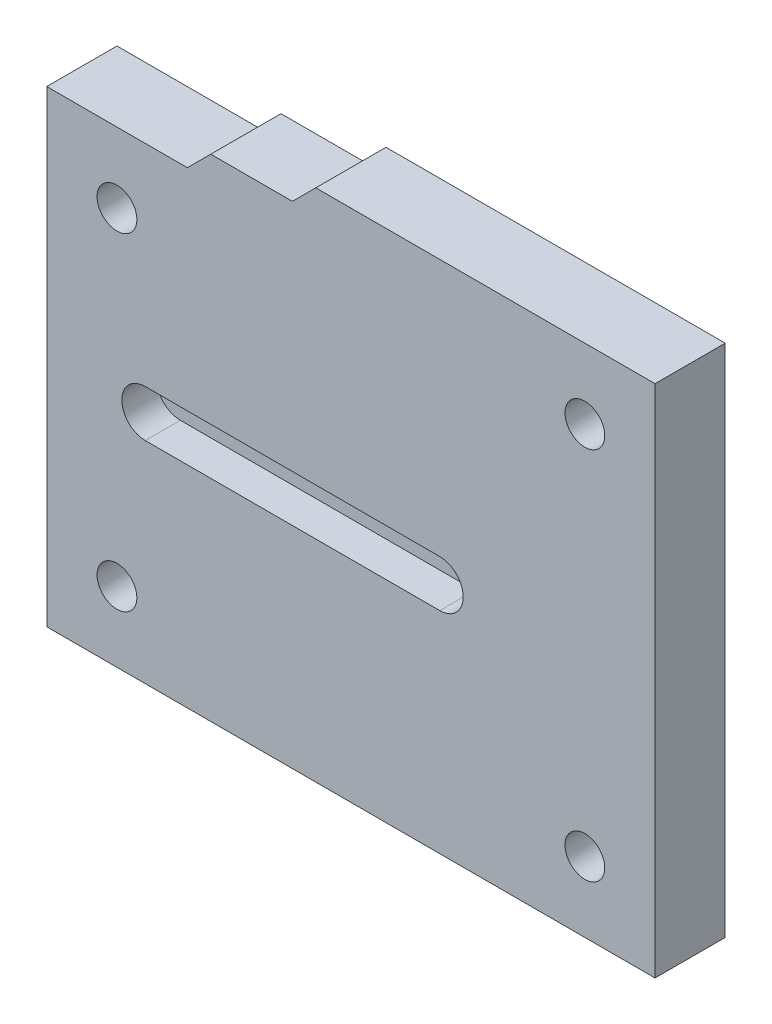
ISO-10303-21;
HEADER;
FILE_DESCRIPTION(('STEP AP214'),'2;1');
FILE_NAME('part.step','',(''),(''),'','','');
FILE_SCHEMA(('AUTOMOTIVE_DESIGN { 1 0 10303 214 1 1 1 1 }'));
ENDSEC;
DATA;
#1=APPLICATION_CONTEXT('core data for automotive mechanical design processes');
#2=APPLICATION_PROTOCOL_DEFINITION('international standard','automotive_design',2000,#1);
#3=PRODUCT_CONTEXT('',#1,'mechanical');
#4=PRODUCT('Part','Part','',(#3));
#5=PRODUCT_RELATED_PRODUCT_CATEGORY('part','',(#4));
#6=PRODUCT_DEFINITION_FORMATION('','',#4);
#7=PRODUCT_DEFINITION_CONTEXT('part definition',#1,'design');
#8=PRODUCT_DEFINITION('design','',#6,#7);
#9=PRODUCT_DEFINITION_SHAPE('','',#8);
#10=(LENGTH_UNIT() NAMED_UNIT(*) SI_UNIT(.MILLI.,.METRE.));
#11=(NAMED_UNIT(*) PLANE_ANGLE_UNIT() SI_UNIT($,.RADIAN.));
#12=(NAMED_UNIT(*) SI_UNIT($,.STERADIAN.) SOLID_ANGLE_UNIT());
#13=UNCERTAINTY_MEASURE_WITH_UNIT(LENGTH_MEASURE(1.E-05),#10,'distance_accuracy_value','');
#14=(GEOMETRIC_REPRESENTATION_CONTEXT(3) GLOBAL_UNCERTAINTY_ASSIGNED_CONTEXT((#13)) GLOBAL_UNIT_ASSIGNED_CONTEXT((#10,
#11,#12)) REPRESENTATION_CONTEXT('',''));
#15=CARTESIAN_POINT('',(0.,0.,0.));
#16=DIRECTION('',(0.,0.,1.));
#17=DIRECTION('',(1.,0.,0.));
#18=AXIS2_PLACEMENT_3D('',#15,#16,#17);
#19=CARTESIAN_POINT('',(-41.6094189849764,34.1564907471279,6.));
#20=DIRECTION('',(0.,0.,-1.));
#21=DIRECTION('',(-1.,0.,0.));
#22=AXIS2_PLACEMENT_3D('',#19,#20,#21);
#23=PLANE('',#22);
#24=CARTESIAN_POINT('',(-35.6094189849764,24.156490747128,6.));
#25=DIRECTION('',(0.,0.,-1.));
#26=DIRECTION('',(-1.,0.,0.));
#27=AXIS2_PLACEMENT_3D('',#24,#25,#26);
#28=CIRCLE('',#27,1.7);
#29=CARTESIAN_POINT('',(-37.3094189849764,24.156490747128,6.));
#30=VERTEX_POINT('',#29);
#31=EDGE_CURVE('E469',#30,#30,#28,.T.);
#32=ORIENTED_EDGE('',*,*,#31,.T.);
#33=EDGE_LOOP('',(#32));
#34=FACE_BOUND('',#33,.T.);
#35=CARTESIAN_POINT('',(-35.6094189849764,-3.84350925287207,6.));
#36=DIRECTION('',(0.,0.,-1.));
#37=DIRECTION('',(-1.,0.,0.));
#38=AXIS2_PLACEMENT_3D('',#35,#36,#37);
#39=CIRCLE('',#38,1.7);
#40=CARTESIAN_POINT('',(-37.3094189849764,-3.84350925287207,6.));
#41=VERTEX_POINT('',#40);
#42=EDGE_CURVE('E480',#41,#41,#39,.T.);
#43=ORIENTED_EDGE('',*,*,#42,.T.);
#44=EDGE_LOOP('',(#43));
#45=FACE_BOUND('',#44,.T.);
#46=CARTESIAN_POINT('',(4.3905810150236,28.156490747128,6.));
#47=DIRECTION('',(0.,0.,-1.));
#48=DIRECTION('',(-1.,0.,0.));
#49=AXIS2_PLACEMENT_3D('',#46,#47,#48);
#50=CIRCLE('',#49,1.7);
#51=CARTESIAN_POINT('',(2.6905810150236,28.156490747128,6.));
#52=VERTEX_POINT('',#51);
#53=EDGE_CURVE('E492',#52,#52,#50,.T.);
#54=ORIENTED_EDGE('',*,*,#53,.T.);
#55=EDGE_LOOP('',(#54));
#56=FACE_BOUND('',#55,.T.);
#57=CARTESIAN_POINT('',(4.3905810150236,-3.84350925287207,6.));
#58=DIRECTION('',(0.,0.,-1.));
#59=DIRECTION('',(-1.,0.,0.));
#60=AXIS2_PLACEMENT_3D('',#57,#58,#59);
#61=CIRCLE('',#60,1.7);
#62=CARTESIAN_POINT('',(2.6905810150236,-3.84350925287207,6.));
#63=VERTEX_POINT('',#62);
#64=EDGE_CURVE('E504',#63,#63,#61,.T.);
#65=ORIENTED_EDGE('',*,*,#64,.T.);
#66=EDGE_LOOP('',(#65));
#67=FACE_BOUND('',#66,.T.);
#68=DIRECTION('',(1.,0.,0.));
#69=VECTOR('',#68,1.);
#70=CARTESIAN_POINT('',(-20.6094189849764,32.1564907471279,6.));
#71=LINE('',#70,#69);
#72=CARTESIAN_POINT('',(-27.5894189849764,32.1564907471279,6.));
#73=VERTEX_POINT('',#72);
#74=CARTESIAN_POINT('',(-20.6094189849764,32.1564907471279,6.));
#75=VERTEX_POINT('',#74);
#76=EDGE_CURVE('E140',#73,#75,#71,.T.);
#77=ORIENTED_EDGE('',*,*,#76,.F.);
#78=DIRECTION('',(-0.707106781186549,-0.707106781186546,0.));
#79=VECTOR('',#78,1.);
#80=CARTESIAN_POINT('',(-29.5894189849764,30.156490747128,6.));
#81=LINE('',#80,#79);
#82=CARTESIAN_POINT('',(-29.5894189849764,30.156490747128,6.));
#83=VERTEX_POINT('',#82);
#84=EDGE_CURVE('E11',#73,#83,#81,.T.);
#85=ORIENTED_EDGE('',*,*,#84,.T.);
#86=DIRECTION('',(-1.,0.,0.));
#87=VECTOR('',#86,1.);
#88=CARTESIAN_POINT('',(-41.6094189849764,30.156490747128,6.));
#89=LINE('',#88,#87);
#90=CARTESIAN_POINT('',(-41.6094189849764,30.156490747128,6.));
#91=VERTEX_POINT('',#90);
#92=EDGE_CURVE('E147',#83,#91,#89,.T.);
#93=ORIENTED_EDGE('',*,*,#92,.T.);
#94=DIRECTION('',(0.,-1.,0.));
#95=VECTOR('',#94,1.);
#96=CARTESIAN_POINT('',(-41.6094189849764,-9.84350925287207,6.));
#97=LINE('',#96,#95);
#98=CARTESIAN_POINT('',(-41.6094189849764,-9.84350925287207,6.));
#99=VERTEX_POINT('',#98);
#100=EDGE_CURVE('E150',#91,#99,#97,.T.);
#101=ORIENTED_EDGE('',*,*,#100,.T.);
#102=DIRECTION('',(1.,0.,0.));
#103=VECTOR('',#102,1.);
#104=CARTESIAN_POINT('',(-41.6094189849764,-9.84350925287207,6.));
#105=LINE('',#104,#103);
#106=CARTESIAN_POINT('',(10.3905810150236,-9.84350925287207,6.));
#107=VERTEX_POINT('',#106);
#108=EDGE_CURVE('E152',#99,#107,#105,.T.);
#109=ORIENTED_EDGE('',*,*,#108,.T.);
#110=DIRECTION('',(0.,1.,0.));
#111=VECTOR('',#110,1.);
#112=CARTESIAN_POINT('',(10.3905810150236,-9.84350925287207,6.));
#113=LINE('',#112,#111);
#114=CARTESIAN_POINT('',(10.3905810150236,34.1564907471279,6.));
#115=VERTEX_POINT('',#114);
#116=EDGE_CURVE('E155',#107,#115,#113,.T.);
#117=ORIENTED_EDGE('',*,*,#116,.T.);
#118=DIRECTION('',(-1.,0.,0.));
#119=VECTOR('',#118,1.);
#120=CARTESIAN_POINT('',(-41.6094189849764,34.1564907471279,6.));
#121=LINE('',#120,#119);
#122=CARTESIAN_POINT('',(-18.6094189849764,34.1564907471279,6.));
#123=VERTEX_POINT('',#122);
#124=EDGE_CURVE('E157',#115,#123,#121,.T.);
#125=ORIENTED_EDGE('',*,*,#124,.T.);
#126=DIRECTION('',(0.707106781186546,0.707106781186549,0.));
#127=VECTOR('',#126,1.);
#128=CARTESIAN_POINT('',(-18.6094189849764,34.1564907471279,6.));
#129=LINE('',#128,#127);
#130=EDGE_CURVE('E179',#123,#75,#129,.F.);
#131=ORIENTED_EDGE('',*,*,#130,.T.);
#132=EDGE_LOOP('',(#77,#85,#93,#101,#109,#117,#125,#131));
#133=FACE_BOUND('',#132,.T.);
#134=CARTESIAN_POINT('',(-33.1894189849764,10.1564907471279,6.));
#135=DIRECTION('',(0.,0.,-1.));
#136=DIRECTION('',(-1.,0.,0.));
#137=AXIS2_PLACEMENT_3D('',#134,#135,#136);
#138=CIRCLE('',#137,2.);
#139=CARTESIAN_POINT('',(-33.1894189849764,8.15649074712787,6.));
#140=VERTEX_POINT('',#139);
#141=CARTESIAN_POINT('',(-33.1894189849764,12.1564907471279,6.));
#142=VERTEX_POINT('',#141);
#143=EDGE_CURVE('E506',#140,#142,#138,.T.);
#144=ORIENTED_EDGE('',*,*,#143,.T.);
#145=DIRECTION('',(1.,0.,0.));
#146=VECTOR('',#145,1.);
#147=CARTESIAN_POINT('',(-8.0094189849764,12.1564907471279,6.));
#148=LINE('',#147,#146);
#149=CARTESIAN_POINT('',(-8.0094189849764,12.1564907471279,6.));
#150=VERTEX_POINT('',#149);
#151=EDGE_CURVE('E125',#142,#150,#148,.T.);
#152=ORIENTED_EDGE('',*,*,#151,.T.);
#153=CARTESIAN_POINT('',(-8.0094189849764,10.1564907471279,6.));
#154=DIRECTION('',(0.,0.,-1.));
#155=DIRECTION('',(-1.,0.,0.));
#156=AXIS2_PLACEMENT_3D('',#153,#154,#155);
#157=CIRCLE('',#156,2.);
#158=CARTESIAN_POINT('',(-8.0094189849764,8.15649074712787,6.));
#159=VERTEX_POINT('',#158);
#160=EDGE_CURVE('E513',#150,#159,#157,.T.);
#161=ORIENTED_EDGE('',*,*,#160,.T.);
#162=DIRECTION('',(-1.,0.,0.));
#163=VECTOR('',#162,1.);
#164=CARTESIAN_POINT('',(-33.1894189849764,8.15649074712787,6.));
#165=LINE('',#164,#163);
#166=EDGE_CURVE('E121',#159,#140,#165,.T.);
#167=ORIENTED_EDGE('',*,*,#166,.T.);
#168=EDGE_LOOP('',(#144,#152,#161,#167));
#169=FACE_BOUND('',#168,.T.);
#170=ADVANCED_FACE('F16',(#34,#45,#56,#67,#133,#169),#23,.F.);
#171=CARTESIAN_POINT('',(-41.6094189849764,30.156490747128,8.));
#172=DIRECTION('',(0.,-1.,0.));
#173=DIRECTION('',(0.,0.,-1.));
#174=AXIS2_PLACEMENT_3D('',#171,#172,#173);
#175=PLANE('',#174);
#176=ORIENTED_EDGE('',*,*,#92,.F.);
#177=DIRECTION('',(0.,0.,-1.));
#178=VECTOR('',#177,1.);
#179=CARTESIAN_POINT('',(-29.5894189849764,30.156490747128,0.));
#180=LINE('',#179,#178);
#181=CARTESIAN_POINT('',(-29.5894189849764,30.156490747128,0.));
#182=VERTEX_POINT('',#181);
#183=EDGE_CURVE('E126',#83,#182,#180,.T.);
#184=ORIENTED_EDGE('',*,*,#183,.T.);
#185=DIRECTION('',(-1.,0.,0.));
#186=VECTOR('',#185,1.);
#187=CARTESIAN_POINT('',(-41.6094189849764,30.156490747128,0.));
#188=LINE('',#187,#186);
#189=CARTESIAN_POINT('',(-41.6094189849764,30.156490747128,0.));
#190=VERTEX_POINT('',#189);
#191=EDGE_CURVE('E142',#182,#190,#188,.T.);
#192=ORIENTED_EDGE('',*,*,#191,.T.);
#193=DIRECTION('',(0.,0.,-1.));
#194=VECTOR('',#193,1.);
#195=CARTESIAN_POINT('',(-41.6094189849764,30.156490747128,8.));
#196=LINE('',#195,#194);
#197=EDGE_CURVE('E144',#91,#190,#196,.T.);
#198=ORIENTED_EDGE('',*,*,#197,.F.);
#199=EDGE_LOOP('',(#176,#184,#192,#198));
#200=FACE_BOUND('',#199,.T.);
#201=ADVANCED_FACE('F215',(#200),#175,.F.);
#202=CARTESIAN_POINT('',(-41.6094189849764,-9.84350925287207,6.));
#203=DIRECTION('',(1.,0.,0.));
#204=DIRECTION('',(0.,0.,-1.));
#205=AXIS2_PLACEMENT_3D('',#202,#203,#204);
#206=PLANE('',#205);
#207=ORIENTED_EDGE('',*,*,#100,.F.);
#208=ORIENTED_EDGE('',*,*,#197,.T.);
#209=DIRECTION('',(0.,-1.,0.));
#210=VECTOR('',#209,1.);
#211=CARTESIAN_POINT('',(-41.6094189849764,-9.84350925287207,0.));
#212=LINE('',#211,#210);
#213=CARTESIAN_POINT('',(-41.6094189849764,-9.84350925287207,0.));
#214=VERTEX_POINT('',#213);
#215=EDGE_CURVE('E149',#190,#214,#212,.T.);
#216=ORIENTED_EDGE('',*,*,#215,.T.);
#217=DIRECTION('',(0.,0.,-1.));
#218=VECTOR('',#217,1.);
#219=CARTESIAN_POINT('',(-41.6094189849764,-9.84350925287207,6.));
#220=LINE('',#219,#218);
#221=EDGE_CURVE('E173',#99,#214,#220,.T.);
#222=ORIENTED_EDGE('',*,*,#221,.F.);
#223=EDGE_LOOP('',(#207,#208,#216,#222));
#224=FACE_BOUND('',#223,.T.);
#225=ADVANCED_FACE('F211',(#224),#206,.F.);
#226=CARTESIAN_POINT('',(-41.6094189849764,-9.84350925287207,6.));
#227=DIRECTION('',(0.,1.,0.));
#228=DIRECTION('',(0.,0.,1.));
#229=AXIS2_PLACEMENT_3D('',#226,#227,#228);
#230=PLANE('',#229);
#231=DIRECTION('',(1.,0.,0.));
#232=VECTOR('',#231,1.);
#233=CARTESIAN_POINT('',(-41.6094189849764,-9.84350925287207,0.));
#234=LINE('',#233,#232);
#235=CARTESIAN_POINT('',(10.3905810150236,-9.84350925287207,0.));
#236=VERTEX_POINT('',#235);
#237=EDGE_CURVE('E162',#214,#236,#234,.T.);
#238=ORIENTED_EDGE('',*,*,#237,.T.);
#239=DIRECTION('',(0.,0.,-1.));
#240=VECTOR('',#239,1.);
#241=CARTESIAN_POINT('',(10.3905810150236,-9.84350925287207,6.));
#242=LINE('',#241,#240);
#243=EDGE_CURVE('E170',#107,#236,#242,.T.);
#244=ORIENTED_EDGE('',*,*,#243,.F.);
#245=ORIENTED_EDGE('',*,*,#108,.F.);
#246=ORIENTED_EDGE('',*,*,#221,.T.);
#247=EDGE_LOOP('',(#238,#244,#245,#246));
#248=FACE_BOUND('',#247,.T.);
#249=ADVANCED_FACE('F208',(#248),#230,.F.);
#250=CARTESIAN_POINT('',(10.3905810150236,-9.84350925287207,6.));
#251=DIRECTION('',(-1.,0.,0.));
#252=DIRECTION('',(0.,0.,1.));
#253=AXIS2_PLACEMENT_3D('',#250,#251,#252);
#254=PLANE('',#253);
#255=DIRECTION('',(0.,1.,0.));
#256=VECTOR('',#255,1.);
#257=CARTESIAN_POINT('',(10.3905810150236,-9.84350925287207,0.));
#258=LINE('',#257,#256);
#259=CARTESIAN_POINT('',(10.3905810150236,34.1564907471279,0.));
#260=VERTEX_POINT('',#259);
#261=EDGE_CURVE('E164',#236,#260,#258,.T.);
#262=ORIENTED_EDGE('',*,*,#261,.T.);
#263=DIRECTION('',(0.,0.,-1.));
#264=VECTOR('',#263,1.);
#265=CARTESIAN_POINT('',(10.3905810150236,34.1564907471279,6.));
#266=LINE('',#265,#264);
#267=EDGE_CURVE('E160',#115,#260,#266,.T.);
#268=ORIENTED_EDGE('',*,*,#267,.F.);
#269=ORIENTED_EDGE('',*,*,#116,.F.);
#270=ORIENTED_EDGE('',*,*,#243,.T.);
#271=EDGE_LOOP('',(#262,#268,#269,#270));
#272=FACE_BOUND('',#271,.T.);
#273=ADVANCED_FACE('F203',(#272),#254,.F.);
#274=CARTESIAN_POINT('',(-41.6094189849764,34.1564907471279,6.));
#275=DIRECTION('',(0.,-1.,0.));
#276=DIRECTION('',(0.,0.,-1.));
#277=AXIS2_PLACEMENT_3D('',#274,#275,#276);
#278=PLANE('',#277);
#279=DIRECTION('',(-1.,0.,0.));
#280=VECTOR('',#279,1.);
#281=CARTESIAN_POINT('',(-41.6094189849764,34.1564907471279,0.));
#282=LINE('',#281,#280);
#283=CARTESIAN_POINT('',(-18.6094189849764,34.1564907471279,0.));
#284=VERTEX_POINT('',#283);
#285=EDGE_CURVE('E153',#260,#284,#282,.T.);
#286=ORIENTED_EDGE('',*,*,#285,.T.);
#287=DIRECTION('',(0.,0.,1.));
#288=VECTOR('',#287,1.);
#289=CARTESIAN_POINT('',(-18.6094189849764,34.1564907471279,6.));
#290=LINE('',#289,#288);
#291=EDGE_CURVE('E176',#284,#123,#290,.T.);
#292=ORIENTED_EDGE('',*,*,#291,.T.);
#293=ORIENTED_EDGE('',*,*,#124,.F.);
#294=ORIENTED_EDGE('',*,*,#267,.T.);
#295=EDGE_LOOP('',(#286,#292,#293,#294));
#296=FACE_BOUND('',#295,.T.);
#297=ADVANCED_FACE('F192',(#296),#278,.F.);
#298=CARTESIAN_POINT('',(-41.6094189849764,34.1564907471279,0.));
#299=DIRECTION('',(0.,0.,-1.));
#300=DIRECTION('',(-1.,0.,0.));
#301=AXIS2_PLACEMENT_3D('',#298,#299,#300);
#302=PLANE('',#301);
#303=CARTESIAN_POINT('',(-35.6094189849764,24.156490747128,0.));
#304=DIRECTION('',(0.,0.,-1.));
#305=DIRECTION('',(-1.,0.,0.));
#306=AXIS2_PLACEMENT_3D('',#303,#304,#305);
#307=CIRCLE('',#306,3.1);
#308=CARTESIAN_POINT('',(-38.7094189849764,24.156490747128,0.));
#309=VERTEX_POINT('',#308);
#310=EDGE_CURVE('E462',#309,#309,#307,.T.);
#311=ORIENTED_EDGE('',*,*,#310,.F.);
#312=EDGE_LOOP('',(#311));
#313=FACE_BOUND('',#312,.T.);
#314=CARTESIAN_POINT('',(-35.6094189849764,-3.84350925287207,0.));
#315=DIRECTION('',(0.,0.,-1.));
#316=DIRECTION('',(-1.,0.,0.));
#317=AXIS2_PLACEMENT_3D('',#314,#315,#316);
#318=CIRCLE('',#317,3.1);
#319=CARTESIAN_POINT('',(-38.7094189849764,-3.84350925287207,0.));
#320=VERTEX_POINT('',#319);
#321=EDGE_CURVE('E471',#320,#320,#318,.T.);
#322=ORIENTED_EDGE('',*,*,#321,.F.);
#323=EDGE_LOOP('',(#322));
#324=FACE_BOUND('',#323,.T.);
#325=CARTESIAN_POINT('',(4.3905810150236,28.156490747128,0.));
#326=DIRECTION('',(0.,0.,-1.));
#327=DIRECTION('',(-1.,0.,0.));
#328=AXIS2_PLACEMENT_3D('',#325,#326,#327);
#329=CIRCLE('',#328,3.1);
#330=CARTESIAN_POINT('',(1.2905810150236,28.156490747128,0.));
#331=VERTEX_POINT('',#330);
#332=EDGE_CURVE('E483',#331,#331,#329,.T.);
#333=ORIENTED_EDGE('',*,*,#332,.F.);
#334=EDGE_LOOP('',(#333));
#335=FACE_BOUND('',#334,.T.);
#336=CARTESIAN_POINT('',(4.3905810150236,-3.84350925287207,0.));
#337=DIRECTION('',(0.,0.,-1.));
#338=DIRECTION('',(-1.,0.,0.));
#339=AXIS2_PLACEMENT_3D('',#336,#337,#338);
#340=CIRCLE('',#339,3.1);
#341=CARTESIAN_POINT('',(1.2905810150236,-3.84350925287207,0.));
#342=VERTEX_POINT('',#341);
#343=EDGE_CURVE('E495',#342,#342,#340,.T.);
#344=ORIENTED_EDGE('',*,*,#343,.F.);
#345=EDGE_LOOP('',(#344));
#346=FACE_BOUND('',#345,.T.);
#347=ORIENTED_EDGE('',*,*,#191,.F.);
#348=DIRECTION('',(0.707106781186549,0.707106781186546,0.));
#349=VECTOR('',#348,1.);
#350=CARTESIAN_POINT('',(-33.5994189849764,26.146490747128,0.));
#351=LINE('',#350,#349);
#352=CARTESIAN_POINT('',(-27.5894189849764,32.1564907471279,0.));
#353=VERTEX_POINT('',#352);
#354=EDGE_CURVE('E38',#182,#353,#351,.T.);
#355=ORIENTED_EDGE('',*,*,#354,.T.);
#356=DIRECTION('',(-1.,0.,0.));
#357=VECTOR('',#356,1.);
#358=CARTESIAN_POINT('',(-20.6094189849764,32.1564907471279,0.));
#359=LINE('',#358,#357);
#360=CARTESIAN_POINT('',(-20.6094189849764,32.1564907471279,0.));
#361=VERTEX_POINT('',#360);
#362=EDGE_CURVE('E138',#361,#353,#359,.T.);
#363=ORIENTED_EDGE('',*,*,#362,.F.);
#364=DIRECTION('',(-0.707106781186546,-0.707106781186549,0.));
#365=VECTOR('',#364,1.);
#366=CARTESIAN_POINT('',(-30.1094189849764,22.656490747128,0.));
#367=LINE('',#366,#365);
#368=EDGE_CURVE('E182',#361,#284,#367,.F.);
#369=ORIENTED_EDGE('',*,*,#368,.T.);
#370=ORIENTED_EDGE('',*,*,#285,.F.);
#371=ORIENTED_EDGE('',*,*,#261,.F.);
#372=ORIENTED_EDGE('',*,*,#237,.F.);
#373=ORIENTED_EDGE('',*,*,#215,.F.);
#374=EDGE_LOOP('',(#347,#355,#363,#369,#370,#371,#372,#373));
#375=FACE_BOUND('',#374,.T.);
#376=ADVANCED_FACE('F186',(#313,#324,#335,#346,#375),#302,.T.);
#377=CARTESIAN_POINT('',(-20.6094189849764,32.1564907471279,0.));
#378=DIRECTION('',(0.,1.,0.));
#379=DIRECTION('',(0.,0.,1.));
#380=AXIS2_PLACEMENT_3D('',#377,#378,#379);
#381=PLANE('',#380);
#382=ORIENTED_EDGE('',*,*,#362,.T.);
#383=DIRECTION('',(0.,0.,1.));
#384=VECTOR('',#383,1.);
#385=CARTESIAN_POINT('',(-27.5894189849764,32.1564907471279,6.));
#386=LINE('',#385,#384);
#387=EDGE_CURVE('E24',#353,#73,#386,.T.);
#388=ORIENTED_EDGE('',*,*,#387,.T.);
#389=ORIENTED_EDGE('',*,*,#76,.T.);
#390=DIRECTION('',(0.,0.,-1.));
#391=VECTOR('',#390,1.);
#392=CARTESIAN_POINT('',(-20.6094189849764,32.1564907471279,6.));
#393=LINE('',#392,#391);
#394=EDGE_CURVE('E130',#75,#361,#393,.T.);
#395=ORIENTED_EDGE('',*,*,#394,.T.);
#396=EDGE_LOOP('',(#382,#388,#389,#395));
#397=FACE_BOUND('',#396,.T.);
#398=ADVANCED_FACE('F243',(#397),#381,.T.);
#399=CARTESIAN_POINT('',(-33.1894189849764,10.1564907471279,3.));
#400=DIRECTION('',(0.,0.,1.));
#401=DIRECTION('',(1.,0.,0.));
#402=AXIS2_PLACEMENT_3D('',#399,#400,#401);
#403=CYLINDRICAL_SURFACE('',#402,2.);
#404=ORIENTED_EDGE('',*,*,#143,.F.);
#405=DIRECTION('',(0.,0.,1.));
#406=VECTOR('',#405,1.);
#407=CARTESIAN_POINT('',(-33.1894189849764,8.15649074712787,3.));
#408=LINE('',#407,#406);
#409=CARTESIAN_POINT('',(-33.1894189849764,8.15649074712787,3.));
#410=VERTEX_POINT('',#409);
#411=EDGE_CURVE('E120',#410,#140,#408,.T.);
#412=ORIENTED_EDGE('',*,*,#411,.F.);
#413=CARTESIAN_POINT('',(-33.1894189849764,10.1564907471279,3.));
#414=DIRECTION('',(0.,0.,-1.));
#415=DIRECTION('',(-1.,0.,0.));
#416=AXIS2_PLACEMENT_3D('',#413,#414,#415);
#417=CIRCLE('',#416,2.);
#418=CARTESIAN_POINT('',(-33.1894189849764,12.1564907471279,3.));
#419=VERTEX_POINT('',#418);
#420=EDGE_CURVE('E107',#410,#419,#417,.T.);
#421=ORIENTED_EDGE('',*,*,#420,.T.);
#422=DIRECTION('',(0.,0.,1.));
#423=VECTOR('',#422,1.);
#424=CARTESIAN_POINT('',(-33.1894189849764,12.1564907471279,3.));
#425=LINE('',#424,#423);
#426=EDGE_CURVE('E117',#419,#142,#425,.T.);
#427=ORIENTED_EDGE('',*,*,#426,.T.);
#428=EDGE_LOOP('',(#404,#412,#421,#427));
#429=FACE_BOUND('',#428,.T.);
#430=ADVANCED_FACE('F116',(#429),#403,.F.);
#431=CARTESIAN_POINT('',(-8.0094189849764,12.1564907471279,3.));
#432=DIRECTION('',(0.,-1.,0.));
#433=DIRECTION('',(0.,0.,-1.));
#434=AXIS2_PLACEMENT_3D('',#431,#432,#433);
#435=PLANE('',#434);
#436=ORIENTED_EDGE('',*,*,#151,.F.);
#437=ORIENTED_EDGE('',*,*,#426,.F.);
#438=DIRECTION('',(1.,0.,0.));
#439=VECTOR('',#438,1.);
#440=CARTESIAN_POINT('',(-8.0094189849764,12.1564907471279,3.));
#441=LINE('',#440,#439);
#442=CARTESIAN_POINT('',(-8.0094189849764,12.1564907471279,3.));
#443=VERTEX_POINT('',#442);
#444=EDGE_CURVE('E103',#419,#443,#441,.T.);
#445=ORIENTED_EDGE('',*,*,#444,.T.);
#446=DIRECTION('',(0.,0.,1.));
#447=VECTOR('',#446,1.);
#448=CARTESIAN_POINT('',(-8.0094189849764,12.1564907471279,3.));
#449=LINE('',#448,#447);
#450=EDGE_CURVE('E127',#443,#150,#449,.T.);
#451=ORIENTED_EDGE('',*,*,#450,.T.);
#452=EDGE_LOOP('',(#436,#437,#445,#451));
#453=FACE_BOUND('',#452,.T.);
#454=ADVANCED_FACE('F123',(#453),#435,.T.);
#455=CARTESIAN_POINT('',(-8.0094189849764,10.1564907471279,3.));
#456=DIRECTION('',(0.,0.,1.));
#457=DIRECTION('',(1.,0.,0.));
#458=AXIS2_PLACEMENT_3D('',#455,#456,#457);
#459=CYLINDRICAL_SURFACE('',#458,2.);
#460=ORIENTED_EDGE('',*,*,#160,.F.);
#461=ORIENTED_EDGE('',*,*,#450,.F.);
#462=CARTESIAN_POINT('',(-8.0094189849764,10.1564907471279,3.));
#463=DIRECTION('',(0.,0.,-1.));
#464=DIRECTION('',(-1.,0.,0.));
#465=AXIS2_PLACEMENT_3D('',#462,#463,#464);
#466=CIRCLE('',#465,2.);
#467=CARTESIAN_POINT('',(-8.0094189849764,8.15649074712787,3.));
#468=VERTEX_POINT('',#467);
#469=EDGE_CURVE('E108',#443,#468,#466,.T.);
#470=ORIENTED_EDGE('',*,*,#469,.T.);
#471=DIRECTION('',(0.,0.,1.));
#472=VECTOR('',#471,1.);
#473=CARTESIAN_POINT('',(-8.0094189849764,8.15649074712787,3.));
#474=LINE('',#473,#472);
#475=EDGE_CURVE('E132',#468,#159,#474,.T.);
#476=ORIENTED_EDGE('',*,*,#475,.T.);
#477=EDGE_LOOP('',(#460,#461,#470,#476));
#478=FACE_BOUND('',#477,.T.);
#479=ADVANCED_FACE('F301',(#478),#459,.F.);
#480=CARTESIAN_POINT('',(-33.1894189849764,8.15649074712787,3.));
#481=DIRECTION('',(0.,1.,0.));
#482=DIRECTION('',(0.,0.,1.));
#483=AXIS2_PLACEMENT_3D('',#480,#481,#482);
#484=PLANE('',#483);
#485=ORIENTED_EDGE('',*,*,#166,.F.);
#486=ORIENTED_EDGE('',*,*,#475,.F.);
#487=DIRECTION('',(-1.,0.,0.));
#488=VECTOR('',#487,1.);
#489=CARTESIAN_POINT('',(-33.1894189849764,8.15649074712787,3.));
#490=LINE('',#489,#488);
#491=EDGE_CURVE('E509',#468,#410,#490,.T.);
#492=ORIENTED_EDGE('',*,*,#491,.T.);
#493=ORIENTED_EDGE('',*,*,#411,.T.);
#494=EDGE_LOOP('',(#485,#486,#492,#493));
#495=FACE_BOUND('',#494,.T.);
#496=ADVANCED_FACE('F309',(#495),#484,.T.);
#497=CARTESIAN_POINT('',(-33.1894189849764,10.1564907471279,3.));
#498=DIRECTION('',(0.,0.,-1.));
#499=DIRECTION('',(-1.,0.,0.));
#500=AXIS2_PLACEMENT_3D('',#497,#498,#499);
#501=PLANE('',#500);
#502=ORIENTED_EDGE('',*,*,#420,.F.);
#503=ORIENTED_EDGE('',*,*,#491,.F.);
#504=ORIENTED_EDGE('',*,*,#469,.F.);
#505=ORIENTED_EDGE('',*,*,#444,.F.);
#506=EDGE_LOOP('',(#502,#503,#504,#505));
#507=FACE_BOUND('',#506,.T.);
#508=ADVANCED_FACE('F105',(#507),#501,.F.);
#509=CARTESIAN_POINT('',(-18.6094189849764,34.1564907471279,6.));
#510=DIRECTION('',(0.707106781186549,-0.707106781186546,0.));
#511=DIRECTION('',(0.707106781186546,0.707106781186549,0.));
#512=AXIS2_PLACEMENT_3D('',#509,#510,#511);
#513=PLANE('',#512);
#514=ORIENTED_EDGE('',*,*,#368,.F.);
#515=ORIENTED_EDGE('',*,*,#394,.F.);
#516=ORIENTED_EDGE('',*,*,#130,.F.);
#517=ORIENTED_EDGE('',*,*,#291,.F.);
#518=EDGE_LOOP('',(#514,#515,#516,#517));
#519=FACE_BOUND('',#518,.T.);
#520=ADVANCED_FACE('F195',(#519),#513,.F.);
#521=CARTESIAN_POINT('',(-29.5894189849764,30.156490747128,0.));
#522=DIRECTION('',(-0.707106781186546,0.707106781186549,0.));
#523=DIRECTION('',(-0.707106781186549,-0.707106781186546,0.));
#524=AXIS2_PLACEMENT_3D('',#521,#522,#523);
#525=PLANE('',#524);
#526=ORIENTED_EDGE('',*,*,#84,.F.);
#527=ORIENTED_EDGE('',*,*,#387,.F.);
#528=ORIENTED_EDGE('',*,*,#354,.F.);
#529=ORIENTED_EDGE('',*,*,#183,.F.);
#530=EDGE_LOOP('',(#526,#527,#528,#529));
#531=FACE_BOUND('',#530,.T.);
#532=ADVANCED_FACE('F18',(#531),#525,.T.);
#533=CARTESIAN_POINT('',(4.3905810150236,-3.84350925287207,0.));
#534=DIRECTION('',(0.,0.,-1.));
#535=DIRECTION('',(-1.,0.,0.));
#536=AXIS2_PLACEMENT_3D('',#533,#534,#535);
#537=CYLINDRICAL_SURFACE('',#536,1.7);
#538=ORIENTED_EDGE('',*,*,#64,.F.);
#539=EDGE_LOOP('',(#538));
#540=FACE_BOUND('',#539,.T.);
#541=CARTESIAN_POINT('',(4.3905810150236,-3.84350925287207,3.));
#542=DIRECTION('',(0.,0.,-1.));
#543=DIRECTION('',(-1.,0.,0.));
#544=AXIS2_PLACEMENT_3D('',#541,#542,#543);
#545=CIRCLE('',#544,1.7);
#546=CARTESIAN_POINT('',(2.6905810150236,-3.84350925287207,3.));
#547=VERTEX_POINT('',#546);
#548=EDGE_CURVE('E501',#547,#547,#545,.T.);
#549=ORIENTED_EDGE('',*,*,#548,.T.);
#550=EDGE_LOOP('',(#549));
#551=FACE_BOUND('',#550,.T.);
#552=ADVANCED_FACE('F219',(#540,#551),#537,.F.);
#553=CARTESIAN_POINT('',(6.09058101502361,-3.84350925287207,3.));
#554=DIRECTION('',(0.,0.,1.));
#555=DIRECTION('',(1.,0.,0.));
#556=AXIS2_PLACEMENT_3D('',#553,#554,#555);
#557=PLANE('',#556);
#558=ORIENTED_EDGE('',*,*,#548,.F.);
#559=EDGE_LOOP('',(#558));
#560=FACE_BOUND('',#559,.T.);
#561=CARTESIAN_POINT('',(4.3905810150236,-3.84350925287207,3.));
#562=DIRECTION('',(0.,0.,-1.));
#563=DIRECTION('',(-1.,0.,0.));
#564=AXIS2_PLACEMENT_3D('',#561,#562,#563);
#565=CIRCLE('',#564,3.1);
#566=CARTESIAN_POINT('',(1.2905810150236,-3.84350925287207,3.));
#567=VERTEX_POINT('',#566);
#568=EDGE_CURVE('E498',#567,#567,#565,.T.);
#569=ORIENTED_EDGE('',*,*,#568,.T.);
#570=EDGE_LOOP('',(#569));
#571=FACE_BOUND('',#570,.T.);
#572=ADVANCED_FACE('F226',(#560,#571),#557,.F.);
#573=CARTESIAN_POINT('',(4.3905810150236,-3.84350925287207,0.));
#574=DIRECTION('',(0.,0.,-1.));
#575=DIRECTION('',(-1.,0.,0.));
#576=AXIS2_PLACEMENT_3D('',#573,#574,#575);
#577=CYLINDRICAL_SURFACE('',#576,3.1);
#578=ORIENTED_EDGE('',*,*,#568,.F.);
#579=EDGE_LOOP('',(#578));
#580=FACE_BOUND('',#579,.T.);
#581=ORIENTED_EDGE('',*,*,#343,.T.);
#582=EDGE_LOOP('',(#581));
#583=FACE_BOUND('',#582,.T.);
#584=ADVANCED_FACE('F350',(#580,#583),#577,.F.);
#585=CARTESIAN_POINT('',(4.3905810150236,28.156490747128,0.));
#586=DIRECTION('',(0.,0.,-1.));
#587=DIRECTION('',(-1.,0.,0.));
#588=AXIS2_PLACEMENT_3D('',#585,#586,#587);
#589=CYLINDRICAL_SURFACE('',#588,1.7);
#590=ORIENTED_EDGE('',*,*,#53,.F.);
#591=EDGE_LOOP('',(#590));
#592=FACE_BOUND('',#591,.T.);
#593=CARTESIAN_POINT('',(4.3905810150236,28.156490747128,3.));
#594=DIRECTION('',(0.,0.,-1.));
#595=DIRECTION('',(-1.,0.,0.));
#596=AXIS2_PLACEMENT_3D('',#593,#594,#595);
#597=CIRCLE('',#596,1.7);
#598=CARTESIAN_POINT('',(2.6905810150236,28.156490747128,3.));
#599=VERTEX_POINT('',#598);
#600=EDGE_CURVE('E489',#599,#599,#597,.T.);
#601=ORIENTED_EDGE('',*,*,#600,.T.);
#602=EDGE_LOOP('',(#601));
#603=FACE_BOUND('',#602,.T.);
#604=ADVANCED_FACE('F360',(#592,#603),#589,.F.);
#605=CARTESIAN_POINT('',(6.09058101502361,28.156490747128,3.));
#606=DIRECTION('',(0.,0.,1.));
#607=DIRECTION('',(1.,0.,0.));
#608=AXIS2_PLACEMENT_3D('',#605,#606,#607);
#609=PLANE('',#608);
#610=ORIENTED_EDGE('',*,*,#600,.F.);
#611=EDGE_LOOP('',(#610));
#612=FACE_BOUND('',#611,.T.);
#613=CARTESIAN_POINT('',(4.3905810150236,28.156490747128,3.));
#614=DIRECTION('',(0.,0.,-1.));
#615=DIRECTION('',(-1.,0.,0.));
#616=AXIS2_PLACEMENT_3D('',#613,#614,#615);
#617=CIRCLE('',#616,3.1);
#618=CARTESIAN_POINT('',(1.2905810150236,28.156490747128,3.));
#619=VERTEX_POINT('',#618);
#620=EDGE_CURVE('E486',#619,#619,#617,.T.);
#621=ORIENTED_EDGE('',*,*,#620,.T.);
#622=EDGE_LOOP('',(#621));
#623=FACE_BOUND('',#622,.T.);
#624=ADVANCED_FACE('F370',(#612,#623),#609,.F.);
#625=CARTESIAN_POINT('',(4.3905810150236,28.156490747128,0.));
#626=DIRECTION('',(0.,0.,-1.));
#627=DIRECTION('',(-1.,0.,0.));
#628=AXIS2_PLACEMENT_3D('',#625,#626,#627);
#629=CYLINDRICAL_SURFACE('',#628,3.1);
#630=ORIENTED_EDGE('',*,*,#620,.F.);
#631=EDGE_LOOP('',(#630));
#632=FACE_BOUND('',#631,.T.);
#633=ORIENTED_EDGE('',*,*,#332,.T.);
#634=EDGE_LOOP('',(#633));
#635=FACE_BOUND('',#634,.T.);
#636=ADVANCED_FACE('F380',(#632,#635),#629,.F.);
#637=CARTESIAN_POINT('',(-35.6094189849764,-3.84350925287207,0.));
#638=DIRECTION('',(0.,0.,-1.));
#639=DIRECTION('',(-1.,0.,0.));
#640=AXIS2_PLACEMENT_3D('',#637,#638,#639);
#641=CYLINDRICAL_SURFACE('',#640,1.7);
#642=ORIENTED_EDGE('',*,*,#42,.F.);
#643=EDGE_LOOP('',(#642));
#644=FACE_BOUND('',#643,.T.);
#645=CARTESIAN_POINT('',(-35.6094189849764,-3.84350925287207,3.));
#646=DIRECTION('',(0.,0.,-1.));
#647=DIRECTION('',(-1.,0.,0.));
#648=AXIS2_PLACEMENT_3D('',#645,#646,#647);
#649=CIRCLE('',#648,1.7);
#650=CARTESIAN_POINT('',(-37.3094189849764,-3.84350925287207,3.));
#651=VERTEX_POINT('',#650);
#652=EDGE_CURVE('E477',#651,#651,#649,.T.);
#653=ORIENTED_EDGE('',*,*,#652,.T.);
#654=EDGE_LOOP('',(#653));
#655=FACE_BOUND('',#654,.T.);
#656=ADVANCED_FACE('F390',(#644,#655),#641,.F.);
#657=CARTESIAN_POINT('',(-33.9094189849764,-3.84350925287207,3.));
#658=DIRECTION('',(0.,0.,1.));
#659=DIRECTION('',(1.,0.,0.));
#660=AXIS2_PLACEMENT_3D('',#657,#658,#659);
#661=PLANE('',#660);
#662=ORIENTED_EDGE('',*,*,#652,.F.);
#663=EDGE_LOOP('',(#662));
#664=FACE_BOUND('',#663,.T.);
#665=CARTESIAN_POINT('',(-35.6094189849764,-3.84350925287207,3.));
#666=DIRECTION('',(0.,0.,-1.));
#667=DIRECTION('',(-1.,0.,0.));
#668=AXIS2_PLACEMENT_3D('',#665,#666,#667);
#669=CIRCLE('',#668,3.1);
#670=CARTESIAN_POINT('',(-38.7094189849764,-3.84350925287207,3.));
#671=VERTEX_POINT('',#670);
#672=EDGE_CURVE('E474',#671,#671,#669,.T.);
#673=ORIENTED_EDGE('',*,*,#672,.T.);
#674=EDGE_LOOP('',(#673));
#675=FACE_BOUND('',#674,.T.);
#676=ADVANCED_FACE('F400',(#664,#675),#661,.F.);
#677=CARTESIAN_POINT('',(-35.6094189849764,-3.84350925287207,0.));
#678=DIRECTION('',(0.,0.,-1.));
#679=DIRECTION('',(-1.,0.,0.));
#680=AXIS2_PLACEMENT_3D('',#677,#678,#679);
#681=CYLINDRICAL_SURFACE('',#680,3.1);
#682=ORIENTED_EDGE('',*,*,#672,.F.);
#683=EDGE_LOOP('',(#682));
#684=FACE_BOUND('',#683,.T.);
#685=ORIENTED_EDGE('',*,*,#321,.T.);
#686=EDGE_LOOP('',(#685));
#687=FACE_BOUND('',#686,.T.);
#688=ADVANCED_FACE('F410',(#684,#687),#681,.F.);
#689=CARTESIAN_POINT('',(-35.6094189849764,24.156490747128,0.));
#690=DIRECTION('',(0.,0.,-1.));
#691=DIRECTION('',(-1.,0.,0.));
#692=AXIS2_PLACEMENT_3D('',#689,#690,#691);
#693=CYLINDRICAL_SURFACE('',#692,1.7);
#694=ORIENTED_EDGE('',*,*,#31,.F.);
#695=EDGE_LOOP('',(#694));
#696=FACE_BOUND('',#695,.T.);
#697=CARTESIAN_POINT('',(-35.6094189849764,24.156490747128,3.));
#698=DIRECTION('',(0.,0.,-1.));
#699=DIRECTION('',(-1.,0.,0.));
#700=AXIS2_PLACEMENT_3D('',#697,#698,#699);
#701=CIRCLE('',#700,1.7);
#702=CARTESIAN_POINT('',(-37.3094189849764,24.156490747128,3.));
#703=VERTEX_POINT('',#702);
#704=EDGE_CURVE('E464',#703,#703,#701,.T.);
#705=ORIENTED_EDGE('',*,*,#704,.T.);
#706=EDGE_LOOP('',(#705));
#707=FACE_BOUND('',#706,.T.);
#708=ADVANCED_FACE('F420',(#696,#707),#693,.F.);
#709=CARTESIAN_POINT('',(-33.9094189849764,24.156490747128,3.));
#710=DIRECTION('',(0.,0.,1.));
#711=DIRECTION('',(1.,0.,0.));
#712=AXIS2_PLACEMENT_3D('',#709,#710,#711);
#713=PLANE('',#712);
#714=ORIENTED_EDGE('',*,*,#704,.F.);
#715=EDGE_LOOP('',(#714));
#716=FACE_BOUND('',#715,.T.);
#717=CARTESIAN_POINT('',(-35.6094189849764,24.156490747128,3.));
#718=DIRECTION('',(0.,0.,-1.));
#719=DIRECTION('',(-1.,0.,0.));
#720=AXIS2_PLACEMENT_3D('',#717,#718,#719);
#721=CIRCLE('',#720,3.1);
#722=CARTESIAN_POINT('',(-38.7094189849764,24.156490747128,3.));
#723=VERTEX_POINT('',#722);
#724=EDGE_CURVE('E459',#723,#723,#721,.T.);
#725=ORIENTED_EDGE('',*,*,#724,.T.);
#726=EDGE_LOOP('',(#725));
#727=FACE_BOUND('',#726,.T.);
#728=ADVANCED_FACE('F430',(#716,#727),#713,.F.);
#729=CARTESIAN_POINT('',(-35.6094189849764,24.156490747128,0.));
#730=DIRECTION('',(0.,0.,-1.));
#731=DIRECTION('',(-1.,0.,0.));
#732=AXIS2_PLACEMENT_3D('',#729,#730,#731);
#733=CYLINDRICAL_SURFACE('',#732,3.1);
#734=ORIENTED_EDGE('',*,*,#724,.F.);
#735=EDGE_LOOP('',(#734));
#736=FACE_BOUND('',#735,.T.);
#737=ORIENTED_EDGE('',*,*,#310,.T.);
#738=EDGE_LOOP('',(#737));
#739=FACE_BOUND('',#738,.T.);
#740=ADVANCED_FACE('F440',(#736,#739),#733,.F.);
#741=CLOSED_SHELL('',(#170,#201,#225,#249,#273,#297,#376,#398,#430,#454,#479,#496,#508,#520,
#532,#552,#572,#584,#604,#624,#636,#656,#676,#688,#708,#728,#740));
#742=MANIFOLD_SOLID_BREP('B1',#741);
#743=ADVANCED_BREP_SHAPE_REPRESENTATION('',(#18,#742),#14);
#744=SHAPE_DEFINITION_REPRESENTATION(#9,#743);
ENDSEC;
END-ISO-10303-21;
